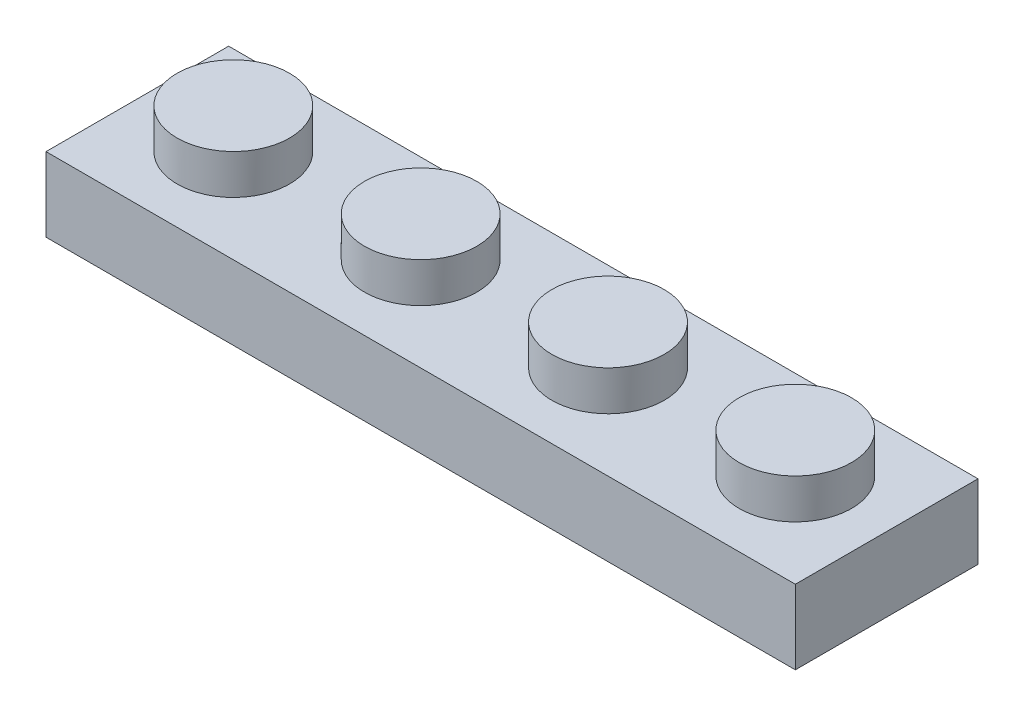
from build123d import *

# Parameters (mm, degrees)
SKETCH1_W       = 32
SKETCH1_H       = 7.8
EXTRUDE1_DEPTH  = 3.166
SKETCH2_R       = 2.4
EXTRUDE2_DEPTH  = 1.7
SKETCH3_W       = 4.8
SKETCH3_H       = 4.8
EXTRUDE3_DEPTH  = 1.75
LPATTERN1_COUNT = 4
LPATTERN1_PITCH = 8
LPATTERN2_COUNT = 4
LPATTERN2_PITCH = 8


with BuildPart() as part:
    # Sketch1 → Extrude1 (new body)
    with BuildSketch(Plane(origin=(0, 0, 0), x_dir=(1, 0, 0), z_dir=(0, 1, 0))):
        with Locations((16, 3.9)):
            Rectangle(SKETCH1_W, SKETCH1_H)
    extrude(amount=EXTRUDE1_DEPTH)

    # Sketch2 → Extrude2 (add)
    with BuildSketch(Plane(origin=(0, 3.166, 0), x_dir=(1, 0, 0), z_dir=(0, 1, 0))):
        with Locations(Location((4, 4, 0), (0, 0, 90))):
            Circle(SKETCH2_R)
    extrude2 = extrude(amount=EXTRUDE2_DEPTH)

    # Sketch3 → Extrude3 (cut)
    with BuildSketch(Plane.XZ):
        with Locations((28.15, -3.95)):
            Rectangle(SKETCH3_W, SKETCH3_H)
    extrude3 = extrude(amount=-EXTRUDE3_DEPTH, mode=Mode.SUBTRACT)

    # LPattern1: Extrude2 ×4
    with Locations(*[(i * LPATTERN1_PITCH, 0, 0) for i in range(1, LPATTERN1_COUNT)]):
        add(extrude2)

    # LPattern2: Extrude3 ×4
    with Locations(*[(-i * LPATTERN2_PITCH, 0, 0) for i in range(1, LPATTERN2_COUNT)]):
        add(extrude3, mode=Mode.SUBTRACT)


solid = part.part
